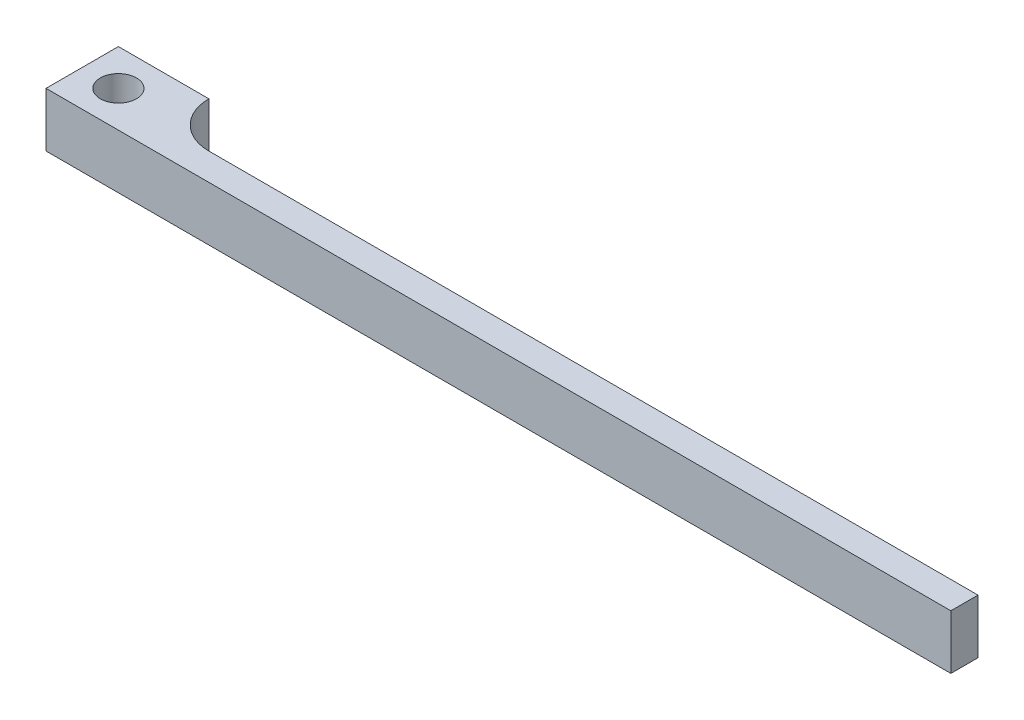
ISO-10303-21;
HEADER;
FILE_DESCRIPTION(('STEP AP214'),'2;1');
FILE_NAME('part.step','',(''),(''),'','','');
FILE_SCHEMA(('AUTOMOTIVE_DESIGN { 1 0 10303 214 1 1 1 1 }'));
ENDSEC;
DATA;
#1=APPLICATION_CONTEXT('core data for automotive mechanical design processes');
#2=APPLICATION_PROTOCOL_DEFINITION('international standard','automotive_design',2000,#1);
#3=PRODUCT_CONTEXT('',#1,'mechanical');
#4=PRODUCT('Part','Part','',(#3));
#5=PRODUCT_RELATED_PRODUCT_CATEGORY('part','',(#4));
#6=PRODUCT_DEFINITION_FORMATION('','',#4);
#7=PRODUCT_DEFINITION_CONTEXT('part definition',#1,'design');
#8=PRODUCT_DEFINITION('design','',#6,#7);
#9=PRODUCT_DEFINITION_SHAPE('','',#8);
#10=(LENGTH_UNIT() NAMED_UNIT(*) SI_UNIT(.MILLI.,.METRE.));
#11=(NAMED_UNIT(*) PLANE_ANGLE_UNIT() SI_UNIT($,.RADIAN.));
#12=(NAMED_UNIT(*) SI_UNIT($,.STERADIAN.) SOLID_ANGLE_UNIT());
#13=UNCERTAINTY_MEASURE_WITH_UNIT(LENGTH_MEASURE(1.E-05),#10,'distance_accuracy_value','');
#14=(GEOMETRIC_REPRESENTATION_CONTEXT(3) GLOBAL_UNCERTAINTY_ASSIGNED_CONTEXT((#13)) GLOBAL_UNIT_ASSIGNED_CONTEXT((#10,
#11,#12)) REPRESENTATION_CONTEXT('',''));
#15=CARTESIAN_POINT('',(0.,0.,0.));
#16=DIRECTION('',(0.,0.,1.));
#17=DIRECTION('',(1.,0.,0.));
#18=AXIS2_PLACEMENT_3D('',#15,#16,#17);
#19=CARTESIAN_POINT('',(0.,0.,3.));
#20=DIRECTION('',(1.,0.,0.));
#21=DIRECTION('',(0.,0.,-1.));
#22=AXIS2_PLACEMENT_3D('',#19,#20,#21);
#23=PLANE('',#22);
#24=DIRECTION('',(0.,0.,-1.));
#25=VECTOR('',#24,1.);
#26=CARTESIAN_POINT('',(0.,6.,3.));
#27=LINE('',#26,#25);
#28=CARTESIAN_POINT('',(0.,6.,3.));
#29=VERTEX_POINT('',#28);
#30=CARTESIAN_POINT('',(0.,6.,-5.));
#31=VERTEX_POINT('',#30);
#32=EDGE_CURVE('E83',#29,#31,#27,.T.);
#33=ORIENTED_EDGE('',*,*,#32,.T.);
#34=DIRECTION('',(0.,1.,0.));
#35=VECTOR('',#34,1.);
#36=CARTESIAN_POINT('',(0.,0.,-5.));
#37=LINE('',#36,#35);
#38=CARTESIAN_POINT('',(0.,0.,-5.));
#39=VERTEX_POINT('',#38);
#40=EDGE_CURVE('E87',#39,#31,#37,.T.);
#41=ORIENTED_EDGE('',*,*,#40,.F.);
#42=DIRECTION('',(0.,0.,-1.));
#43=VECTOR('',#42,1.);
#44=CARTESIAN_POINT('',(0.,0.,3.));
#45=LINE('',#44,#43);
#46=CARTESIAN_POINT('',(0.,0.,3.));
#47=VERTEX_POINT('',#46);
#48=EDGE_CURVE('E126',#47,#39,#45,.T.);
#49=ORIENTED_EDGE('',*,*,#48,.F.);
#50=DIRECTION('',(0.,-1.,0.));
#51=VECTOR('',#50,1.);
#52=CARTESIAN_POINT('',(0.,0.,3.));
#53=LINE('',#52,#51);
#54=EDGE_CURVE('E89',#29,#47,#53,.T.);
#55=ORIENTED_EDGE('',*,*,#54,.F.);
#56=EDGE_LOOP('',(#33,#41,#49,#55));
#57=FACE_BOUND('',#56,.T.);
#58=ADVANCED_FACE('F31',(#57),#23,.F.);
#59=CARTESIAN_POINT('',(0.,0.,3.));
#60=DIRECTION('',(0.,1.,0.));
#61=DIRECTION('',(0.,0.,1.));
#62=AXIS2_PLACEMENT_3D('',#59,#60,#61);
#63=PLANE('',#62);
#64=CARTESIAN_POINT('',(4.,0.,-1.));
#65=DIRECTION('',(0.,1.,0.));
#66=DIRECTION('',(0.,0.,1.));
#67=AXIS2_PLACEMENT_3D('',#64,#65,#66);
#68=CIRCLE('',#67,2.);
#69=CARTESIAN_POINT('',(4.,0.,1.));
#70=VERTEX_POINT('',#69);
#71=EDGE_CURVE('E107',#70,#70,#68,.T.);
#72=ORIENTED_EDGE('',*,*,#71,.T.);
#73=EDGE_LOOP('',(#72));
#74=FACE_BOUND('',#73,.T.);
#75=ORIENTED_EDGE('',*,*,#48,.T.);
#76=DIRECTION('',(-1.,0.,0.));
#77=VECTOR('',#76,1.);
#78=CARTESIAN_POINT('',(0.,0.,-5.));
#79=LINE('',#78,#77);
#80=CARTESIAN_POINT('',(10.,0.,-5.));
#81=VERTEX_POINT('',#80);
#82=EDGE_CURVE('E106',#81,#39,#79,.T.);
#83=ORIENTED_EDGE('',*,*,#82,.F.);
#84=CARTESIAN_POINT('',(15.,0.,-5.));
#85=DIRECTION('',(0.,1.,0.));
#86=DIRECTION('',(0.,0.,1.));
#87=AXIS2_PLACEMENT_3D('',#84,#85,#86);
#88=CIRCLE('',#87,5.);
#89=CARTESIAN_POINT('',(15.,0.,0.));
#90=VERTEX_POINT('',#89);
#91=EDGE_CURVE('E38',#81,#90,#88,.T.);
#92=ORIENTED_EDGE('',*,*,#91,.T.);
#93=DIRECTION('',(1.,0.,0.));
#94=VECTOR('',#93,1.);
#95=CARTESIAN_POINT('',(0.,0.,0.));
#96=LINE('',#95,#94);
#97=CARTESIAN_POINT('',(100.,0.,0.));
#98=VERTEX_POINT('',#97);
#99=EDGE_CURVE('E116',#90,#98,#96,.T.);
#100=ORIENTED_EDGE('',*,*,#99,.T.);
#101=DIRECTION('',(0.,0.,-1.));
#102=VECTOR('',#101,1.);
#103=CARTESIAN_POINT('',(100.,0.,3.));
#104=LINE('',#103,#102);
#105=CARTESIAN_POINT('',(100.,0.,3.));
#106=VERTEX_POINT('',#105);
#107=EDGE_CURVE('E127',#106,#98,#104,.T.);
#108=ORIENTED_EDGE('',*,*,#107,.F.);
#109=DIRECTION('',(1.,0.,0.));
#110=VECTOR('',#109,1.);
#111=CARTESIAN_POINT('',(0.,0.,3.));
#112=LINE('',#111,#110);
#113=EDGE_CURVE('E136',#47,#106,#112,.T.);
#114=ORIENTED_EDGE('',*,*,#113,.F.);
#115=EDGE_LOOP('',(#75,#83,#92,#100,#108,#114));
#116=FACE_BOUND('',#115,.T.);
#117=ADVANCED_FACE('F158',(#74,#116),#63,.F.);
#118=CARTESIAN_POINT('',(100.,0.,3.));
#119=DIRECTION('',(-1.,0.,0.));
#120=DIRECTION('',(0.,0.,1.));
#121=AXIS2_PLACEMENT_3D('',#118,#119,#120);
#122=PLANE('',#121);
#123=DIRECTION('',(0.,1.,0.));
#124=VECTOR('',#123,1.);
#125=CARTESIAN_POINT('',(100.,0.,0.));
#126=LINE('',#125,#124);
#127=CARTESIAN_POINT('',(100.,6.,0.));
#128=VERTEX_POINT('',#127);
#129=EDGE_CURVE('E119',#98,#128,#126,.T.);
#130=ORIENTED_EDGE('',*,*,#129,.T.);
#131=DIRECTION('',(0.,0.,-1.));
#132=VECTOR('',#131,1.);
#133=CARTESIAN_POINT('',(100.,6.,3.));
#134=LINE('',#133,#132);
#135=CARTESIAN_POINT('',(100.,6.,3.));
#136=VERTEX_POINT('',#135);
#137=EDGE_CURVE('E92',#136,#128,#134,.T.);
#138=ORIENTED_EDGE('',*,*,#137,.F.);
#139=DIRECTION('',(0.,1.,0.));
#140=VECTOR('',#139,1.);
#141=CARTESIAN_POINT('',(100.,0.,3.));
#142=LINE('',#141,#140);
#143=EDGE_CURVE('E134',#106,#136,#142,.T.);
#144=ORIENTED_EDGE('',*,*,#143,.F.);
#145=ORIENTED_EDGE('',*,*,#107,.T.);
#146=EDGE_LOOP('',(#130,#138,#144,#145));
#147=FACE_BOUND('',#146,.T.);
#148=ADVANCED_FACE('F143',(#147),#122,.F.);
#149=CARTESIAN_POINT('',(0.,6.,3.));
#150=DIRECTION('',(0.,-1.,0.));
#151=DIRECTION('',(0.,0.,-1.));
#152=AXIS2_PLACEMENT_3D('',#149,#150,#151);
#153=PLANE('',#152);
#154=CARTESIAN_POINT('',(4.,6.,-1.));
#155=DIRECTION('',(0.,1.,0.));
#156=DIRECTION('',(0.,0.,1.));
#157=AXIS2_PLACEMENT_3D('',#154,#155,#156);
#158=CIRCLE('',#157,2.);
#159=CARTESIAN_POINT('',(4.,6.,1.));
#160=VERTEX_POINT('',#159);
#161=EDGE_CURVE('E110',#160,#160,#158,.T.);
#162=ORIENTED_EDGE('',*,*,#161,.F.);
#163=EDGE_LOOP('',(#162));
#164=FACE_BOUND('',#163,.T.);
#165=DIRECTION('',(-1.,0.,0.));
#166=VECTOR('',#165,1.);
#167=CARTESIAN_POINT('',(0.,6.,0.));
#168=LINE('',#167,#166);
#169=CARTESIAN_POINT('',(15.,6.,0.));
#170=VERTEX_POINT('',#169);
#171=EDGE_CURVE('E124',#128,#170,#168,.T.);
#172=ORIENTED_EDGE('',*,*,#171,.T.);
#173=CARTESIAN_POINT('',(15.,6.,-5.));
#174=DIRECTION('',(0.,-1.,0.));
#175=DIRECTION('',(0.,0.,-1.));
#176=AXIS2_PLACEMENT_3D('',#173,#174,#175);
#177=CIRCLE('',#176,5.);
#178=CARTESIAN_POINT('',(9.99999999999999,6.,-5.));
#179=VERTEX_POINT('',#178);
#180=EDGE_CURVE('E11',#170,#179,#177,.T.);
#181=ORIENTED_EDGE('',*,*,#180,.T.);
#182=DIRECTION('',(1.,0.,0.));
#183=VECTOR('',#182,1.);
#184=CARTESIAN_POINT('',(0.,6.,-5.));
#185=LINE('',#184,#183);
#186=EDGE_CURVE('E96',#31,#179,#185,.T.);
#187=ORIENTED_EDGE('',*,*,#186,.F.);
#188=ORIENTED_EDGE('',*,*,#32,.F.);
#189=DIRECTION('',(-1.,0.,0.));
#190=VECTOR('',#189,1.);
#191=CARTESIAN_POINT('',(0.,6.,3.));
#192=LINE('',#191,#190);
#193=EDGE_CURVE('E93',#136,#29,#192,.T.);
#194=ORIENTED_EDGE('',*,*,#193,.F.);
#195=ORIENTED_EDGE('',*,*,#137,.T.);
#196=EDGE_LOOP('',(#172,#181,#187,#188,#194,#195));
#197=FACE_BOUND('',#196,.T.);
#198=ADVANCED_FACE('F97',(#164,#197),#153,.F.);
#199=CARTESIAN_POINT('',(0.,6.,3.));
#200=DIRECTION('',(0.,0.,-1.));
#201=DIRECTION('',(-1.,0.,0.));
#202=AXIS2_PLACEMENT_3D('',#199,#200,#201);
#203=PLANE('',#202);
#204=ORIENTED_EDGE('',*,*,#54,.T.);
#205=ORIENTED_EDGE('',*,*,#113,.T.);
#206=ORIENTED_EDGE('',*,*,#143,.T.);
#207=ORIENTED_EDGE('',*,*,#193,.T.);
#208=EDGE_LOOP('',(#204,#205,#206,#207));
#209=FACE_BOUND('',#208,.T.);
#210=ADVANCED_FACE('F148',(#209),#203,.F.);
#211=CARTESIAN_POINT('',(0.,6.,0.));
#212=DIRECTION('',(0.,0.,-1.));
#213=DIRECTION('',(-1.,0.,0.));
#214=AXIS2_PLACEMENT_3D('',#211,#212,#213);
#215=PLANE('',#214);
#216=ORIENTED_EDGE('',*,*,#99,.F.);
#217=DIRECTION('',(0.,-1.,0.));
#218=VECTOR('',#217,1.);
#219=CARTESIAN_POINT('',(15.,6.00000000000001,0.));
#220=LINE('',#219,#218);
#221=EDGE_CURVE('E51',#90,#170,#220,.F.);
#222=ORIENTED_EDGE('',*,*,#221,.T.);
#223=ORIENTED_EDGE('',*,*,#171,.F.);
#224=ORIENTED_EDGE('',*,*,#129,.F.);
#225=EDGE_LOOP('',(#216,#222,#223,#224));
#226=FACE_BOUND('',#225,.T.);
#227=ADVANCED_FACE('F146',(#226),#215,.T.);
#228=CARTESIAN_POINT('',(0.,6.,-5.));
#229=DIRECTION('',(0.,0.,-1.));
#230=DIRECTION('',(-1.,0.,0.));
#231=AXIS2_PLACEMENT_3D('',#228,#229,#230);
#232=PLANE('',#231);
#233=ORIENTED_EDGE('',*,*,#40,.T.);
#234=ORIENTED_EDGE('',*,*,#186,.T.);
#235=DIRECTION('',(0.,-1.,0.));
#236=VECTOR('',#235,1.);
#237=CARTESIAN_POINT('',(10.,0.,-5.));
#238=LINE('',#237,#236);
#239=EDGE_CURVE('E102',#179,#81,#238,.T.);
#240=ORIENTED_EDGE('',*,*,#239,.T.);
#241=ORIENTED_EDGE('',*,*,#82,.T.);
#242=EDGE_LOOP('',(#233,#234,#240,#241));
#243=FACE_BOUND('',#242,.T.);
#244=ADVANCED_FACE('F105',(#243),#232,.T.);
#245=CARTESIAN_POINT('',(15.,0.,-5.));
#246=DIRECTION('',(0.,-1.,0.));
#247=DIRECTION('',(1.,0.,0.));
#248=AXIS2_PLACEMENT_3D('',#245,#246,#247);
#249=CYLINDRICAL_SURFACE('',#248,5.);
#250=ORIENTED_EDGE('',*,*,#180,.F.);
#251=ORIENTED_EDGE('',*,*,#221,.F.);
#252=ORIENTED_EDGE('',*,*,#91,.F.);
#253=ORIENTED_EDGE('',*,*,#239,.F.);
#254=EDGE_LOOP('',(#250,#251,#252,#253));
#255=FACE_BOUND('',#254,.T.);
#256=ADVANCED_FACE('F154',(#255),#249,.F.);
#257=CARTESIAN_POINT('',(4.,0.,-1.));
#258=DIRECTION('',(0.,1.,0.));
#259=DIRECTION('',(0.,0.,1.));
#260=AXIS2_PLACEMENT_3D('',#257,#258,#259);
#261=CYLINDRICAL_SURFACE('',#260,2.);
#262=CARTESIAN_POINT('',(4.,0.,1.));
#263=CARTESIAN_POINT('',(4.,0.0624999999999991,1.));
#264=CARTESIAN_POINT('',(4.,0.124999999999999,1.));
#265=CARTESIAN_POINT('',(4.,0.249999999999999,1.));
#266=CARTESIAN_POINT('',(4.,0.312499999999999,1.));
#267=CARTESIAN_POINT('',(4.,0.437499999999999,1.));
#268=CARTESIAN_POINT('',(4.,0.499999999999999,1.));
#269=CARTESIAN_POINT('',(4.,0.624999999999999,1.));
#270=CARTESIAN_POINT('',(4.,0.687499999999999,1.));
#271=CARTESIAN_POINT('',(4.,0.812499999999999,1.));
#272=CARTESIAN_POINT('',(4.,0.874999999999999,1.));
#273=CARTESIAN_POINT('',(4.,0.999999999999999,1.));
#274=CARTESIAN_POINT('',(4.,1.0625,1.));
#275=CARTESIAN_POINT('',(4.,1.1875,1.));
#276=CARTESIAN_POINT('',(4.,1.25,1.));
#277=CARTESIAN_POINT('',(4.,1.375,1.));
#278=CARTESIAN_POINT('',(4.,1.4375,1.));
#279=CARTESIAN_POINT('',(4.,1.5625,1.));
#280=CARTESIAN_POINT('',(4.,1.625,1.));
#281=CARTESIAN_POINT('',(4.,1.75,1.));
#282=CARTESIAN_POINT('',(4.,1.8125,1.));
#283=CARTESIAN_POINT('',(4.,1.9375,1.));
#284=CARTESIAN_POINT('',(4.,2.,1.));
#285=CARTESIAN_POINT('',(4.,2.125,1.));
#286=CARTESIAN_POINT('',(4.,2.1875,1.));
#287=CARTESIAN_POINT('',(4.,2.3125,1.));
#288=CARTESIAN_POINT('',(4.,2.375,1.));
#289=CARTESIAN_POINT('',(4.,2.5,1.));
#290=CARTESIAN_POINT('',(4.,2.5625,1.));
#291=CARTESIAN_POINT('',(4.,2.6875,1.));
#292=CARTESIAN_POINT('',(4.,2.75,1.));
#293=CARTESIAN_POINT('',(4.,2.875,1.));
#294=CARTESIAN_POINT('',(4.,2.9375,1.));
#295=CARTESIAN_POINT('',(4.,3.0625,1.));
#296=CARTESIAN_POINT('',(4.,3.125,1.));
#297=CARTESIAN_POINT('',(4.,3.25,1.));
#298=CARTESIAN_POINT('',(4.,3.3125,1.));
#299=CARTESIAN_POINT('',(4.,3.4375,1.));
#300=CARTESIAN_POINT('',(4.,3.5,1.));
#301=CARTESIAN_POINT('',(4.,3.625,1.));
#302=CARTESIAN_POINT('',(4.,3.6875,1.));
#303=CARTESIAN_POINT('',(4.,3.8125,1.));
#304=CARTESIAN_POINT('',(4.,3.875,1.));
#305=CARTESIAN_POINT('',(4.,4.,1.));
#306=CARTESIAN_POINT('',(4.,4.0625,1.));
#307=CARTESIAN_POINT('',(4.,4.1875,1.));
#308=CARTESIAN_POINT('',(4.,4.25,1.));
#309=CARTESIAN_POINT('',(4.,4.375,1.));
#310=CARTESIAN_POINT('',(4.,4.4375,1.));
#311=CARTESIAN_POINT('',(4.,4.5625,1.));
#312=CARTESIAN_POINT('',(4.,4.625,1.));
#313=CARTESIAN_POINT('',(4.,4.75,1.));
#314=CARTESIAN_POINT('',(4.,4.8125,1.));
#315=CARTESIAN_POINT('',(4.,4.9375,1.));
#316=CARTESIAN_POINT('',(4.,5.,1.));
#317=CARTESIAN_POINT('',(4.,5.125,1.));
#318=CARTESIAN_POINT('',(4.,5.1875,1.));
#319=CARTESIAN_POINT('',(4.,5.3125,1.));
#320=CARTESIAN_POINT('',(4.,5.375,1.));
#321=CARTESIAN_POINT('',(4.,5.5,1.));
#322=CARTESIAN_POINT('',(4.,5.5625,1.));
#323=CARTESIAN_POINT('',(4.,5.6875,1.));
#324=CARTESIAN_POINT('',(4.,5.75,1.));
#325=CARTESIAN_POINT('',(4.,5.875,1.));
#326=CARTESIAN_POINT('',(4.,5.9375,1.));
#327=CARTESIAN_POINT('',(4.,6.,1.));
#328=B_SPLINE_CURVE_WITH_KNOTS('',3,(#262,#263,#264,#265,#266,#267,#268,#269,#270,#271,#272,
#273,#274,#275,#276,#277,#278,#279,#280,#281,#282,#283,#284,#285,#286,#287,#288,#289,#290,#291,
#292,#293,#294,#295,#296,#297,#298,#299,#300,#301,#302,#303,#304,#305,#306,#307,#308,#309,#310,
#311,#312,#313,#314,#315,#316,#317,#318,#319,#320,#321,#322,#323,#324,#325,#326,#327),
.UNSPECIFIED.,.F.,.F.,(4,2,2,2,2,2,2,2,2,2,2,2,2,2,2,2,2,2,2,2,2,2,2,2,2,2,2,2,2,2,2,2,4),(0.,
0.1875,0.375,0.5625,0.75,0.9375,1.125,1.3125,1.5,1.6875,1.875,2.0625,2.25,2.4375,2.625,2.8125,
3.,3.1875,3.375,3.5625,3.75,3.9375,4.125,4.3125,4.5,4.6875,4.875,5.0625,5.25,5.4375,5.625,
5.8125,6.),.UNSPECIFIED.);
#329=EDGE_CURVE('BSEAM177',#70,#160,#328,.T.);
#330=ORIENTED_EDGE('',*,*,#71,.F.);
#331=ORIENTED_EDGE('',*,*,#161,.T.);
#332=ORIENTED_EDGE('',*,*,#329,.T.);
#333=ORIENTED_EDGE('',*,*,#329,.F.);
#334=EDGE_LOOP('',(#330,#332,#331,#333));
#335=FACE_BOUND('',#334,.T.);
#336=ADVANCED_FACE('F177',(#335),#261,.F.);
#337=CLOSED_SHELL('',(#58,#117,#148,#198,#210,#227,#244,#256,#336));
#338=MANIFOLD_SOLID_BREP('B2',#337);
#339=ADVANCED_BREP_SHAPE_REPRESENTATION('',(#18,#338),#14);
#340=SHAPE_DEFINITION_REPRESENTATION(#9,#339);
ENDSEC;
END-ISO-10303-21;
